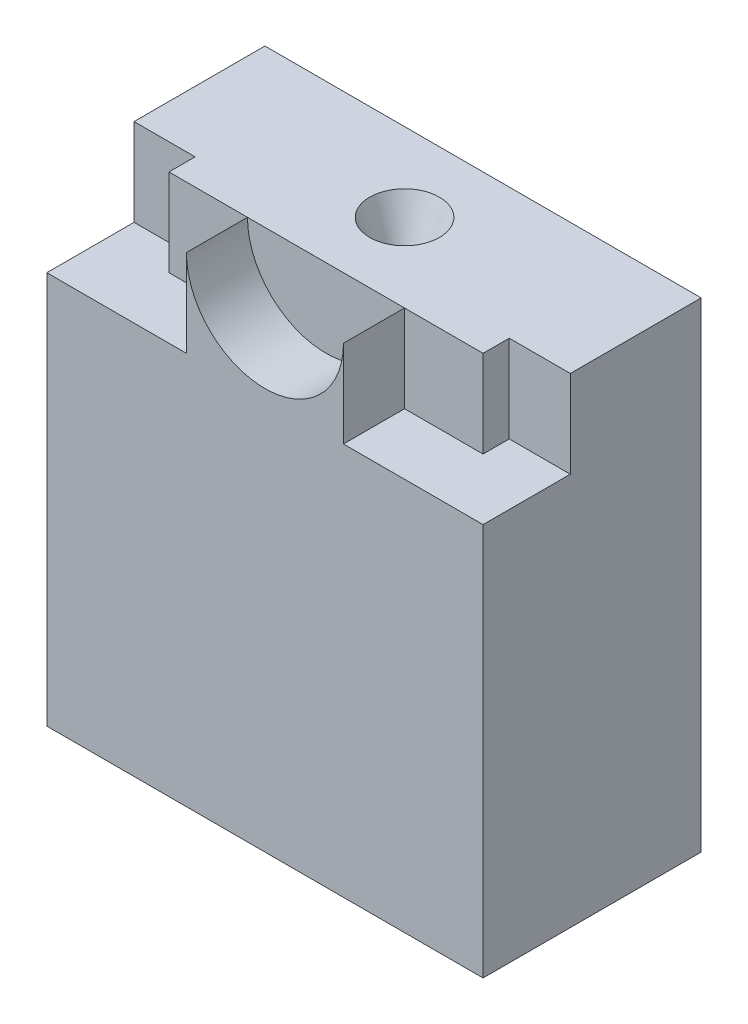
from build123d import *

# Parameters (mm, degrees)
SKETCH_1_W          = 50
SKETCH_1_H          = 25
EXTRUDE_1_DEPTH     = 55
CUT_EXTRUDE_3_DEPTH = 10
SKETCH_6_W          = 9
SKETCH_6_H          = 7


with BuildPart() as part:
    # Sketch 1 → Extrude 1 (new body)
    with BuildSketch(Plane(origin=(0, 0, 0), x_dir=(1, 0, 0), z_dir=(0, 1, 0))):
        Rectangle(SKETCH_1_W, SKETCH_1_H)
    extrude(amount=EXTRUDE_1_DEPTH)

    # Sketch 4 → Cut-Extrude 3 (cut)
    with BuildSketch(Plane(origin=(0, 55, 0), x_dir=(1, 0, 0), z_dir=(0, 1, 0))):
        Polygon((-9, -5.5), (-18, -5.5), (-18, -2.5), (-25, -2.5), (-25, -12.5), (-9, -12.5), align=None)
        Polygon((9, -12.5), (9, -5.5), (18, -5.5), (18, -2.5), (25, -2.5), (25, -12.5), align=None)
    extrude(amount=-CUT_EXTRUDE_3_DEPTH, mode=Mode.SUBTRACT)

    # Sketch 5 → Cut-Revolve 1 (revolve, cut)
    with BuildSketch(Plane(origin=(0, 0, 0), x_dir=(0, 0, -1), z_dir=(1, 0, 0))):
        Polygon((3.5, 55), (-0.5, 55), (3.5, 45.559401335), align=None)
    revolve(axis=Axis((0, 4.092667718, -3.5), (0, 1, 0)), mode=Mode.SUBTRACT)

    # Sketch 6 → Cut-Revolve 2 (revolve, cut)
    with BuildSketch(Plane(origin=(0, 55, 0), x_dir=(1, 0, 0), z_dir=(0, 1, 0))):
        with Locations((4.5, -9)):
            Rectangle(SKETCH_6_W, SKETCH_6_H)
    revolve(axis=Axis((0, 55, 0), (0, 0, 1)), mode=Mode.SUBTRACT)


solid = part.part
